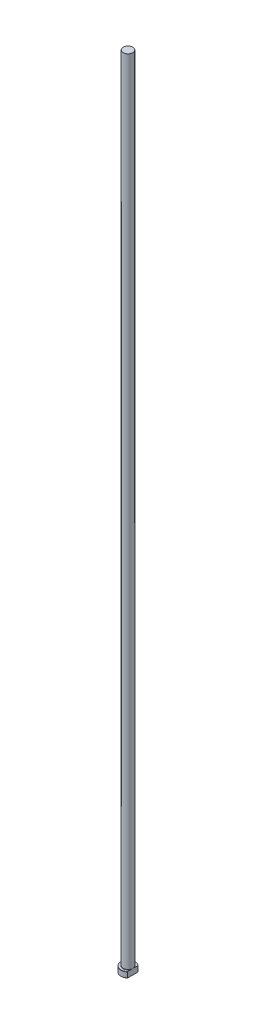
ISO-10303-21;
HEADER;
FILE_DESCRIPTION(('STEP AP214'),'2;1');
FILE_NAME('part.step','',(''),(''),'','','');
FILE_SCHEMA(('AUTOMOTIVE_DESIGN { 1 0 10303 214 1 1 1 1 }'));
ENDSEC;
DATA;
#1=APPLICATION_CONTEXT('core data for automotive mechanical design processes');
#2=APPLICATION_PROTOCOL_DEFINITION('international standard','automotive_design',2000,#1);
#3=PRODUCT_CONTEXT('',#1,'mechanical');
#4=PRODUCT('Part','Part','',(#3));
#5=PRODUCT_RELATED_PRODUCT_CATEGORY('part','',(#4));
#6=PRODUCT_DEFINITION_FORMATION('','',#4);
#7=PRODUCT_DEFINITION_CONTEXT('part definition',#1,'design');
#8=PRODUCT_DEFINITION('design','',#6,#7);
#9=PRODUCT_DEFINITION_SHAPE('','',#8);
#10=(LENGTH_UNIT() NAMED_UNIT(*) SI_UNIT(.MILLI.,.METRE.));
#11=(NAMED_UNIT(*) PLANE_ANGLE_UNIT() SI_UNIT($,.RADIAN.));
#12=(NAMED_UNIT(*) SI_UNIT($,.STERADIAN.) SOLID_ANGLE_UNIT());
#13=UNCERTAINTY_MEASURE_WITH_UNIT(LENGTH_MEASURE(1.E-05),#10,'distance_accuracy_value','');
#14=(GEOMETRIC_REPRESENTATION_CONTEXT(3) GLOBAL_UNCERTAINTY_ASSIGNED_CONTEXT((#13)) GLOBAL_UNIT_ASSIGNED_CONTEXT((#10,
#11,#12)) REPRESENTATION_CONTEXT('',''));
#15=CARTESIAN_POINT('',(0.,0.,0.));
#16=DIRECTION('',(0.,0.,1.));
#17=DIRECTION('',(1.,0.,0.));
#18=AXIS2_PLACEMENT_3D('',#15,#16,#17);
#19=CARTESIAN_POINT('',(0.,0.,0.));
#20=DIRECTION('',(0.,-1.,0.));
#21=DIRECTION('',(0.,0.,-1.));
#22=AXIS2_PLACEMENT_3D('',#19,#20,#21);
#23=PLANE('',#22);
#24=CARTESIAN_POINT('',(0.,0.,0.));
#25=DIRECTION('',(0.,-1.,0.));
#26=DIRECTION('',(0.,0.,-1.));
#27=AXIS2_PLACEMENT_3D('',#24,#25,#26);
#28=CIRCLE('',#27,8.79999999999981);
#29=CARTESIAN_POINT('',(5.99999999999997,0.,6.4373907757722));
#30=VERTEX_POINT('',#29);
#31=CARTESIAN_POINT('',(5.99999999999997,0.,-6.4373907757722));
#32=VERTEX_POINT('',#31);
#33=EDGE_CURVE('E98',#30,#32,#28,.T.);
#34=ORIENTED_EDGE('',*,*,#33,.T.);
#35=DIRECTION('',(0.,0.,1.));
#36=VECTOR('',#35,1.);
#37=CARTESIAN_POINT('',(5.99999999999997,0.,-6.70820393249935));
#38=LINE('',#37,#36);
#39=EDGE_CURVE('E83',#32,#30,#38,.T.);
#40=ORIENTED_EDGE('',*,*,#39,.T.);
#41=EDGE_LOOP('',(#34,#40));
#42=FACE_BOUND('',#41,.T.);
#43=ADVANCED_FACE('F32',(#42),#23,.T.);
#44=CARTESIAN_POINT('',(0.,259.958771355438,0.));
#45=DIRECTION('',(0.,1.,0.));
#46=DIRECTION('',(0.,0.,1.));
#47=AXIS2_PLACEMENT_3D('',#44,#45,#46);
#48=CYLINDRICAL_SURFACE('',#47,8.99999999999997);
#49=CARTESIAN_POINT('',(0.,6.79999999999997,0.));
#50=DIRECTION('',(0.,1.,0.));
#51=DIRECTION('',(0.,0.,1.));
#52=AXIS2_PLACEMENT_3D('',#49,#50,#51);
#53=CIRCLE('',#52,8.99999999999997);
#54=CARTESIAN_POINT('',(5.99999999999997,6.79999999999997,6.70820393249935));
#55=VERTEX_POINT('',#54);
#56=CARTESIAN_POINT('',(5.99999999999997,6.79999999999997,-6.70820393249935));
#57=VERTEX_POINT('',#56);
#58=EDGE_CURVE('E104',#55,#57,#53,.F.);
#59=ORIENTED_EDGE('',*,*,#58,.T.);
#60=DIRECTION('',(0.,-1.,0.));
#61=VECTOR('',#60,1.);
#62=CARTESIAN_POINT('',(5.99999999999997,1000.,-6.70820393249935));
#63=LINE('',#62,#61);
#64=CARTESIAN_POINT('',(5.99999999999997,0.200000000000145,-6.70820393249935));
#65=VERTEX_POINT('',#64);
#66=EDGE_CURVE('E183',#57,#65,#63,.T.);
#67=ORIENTED_EDGE('',*,*,#66,.T.);
#68=CARTESIAN_POINT('',(0.,0.200000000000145,0.));
#69=DIRECTION('',(0.,-1.,0.));
#70=DIRECTION('',(0.,0.,-1.));
#71=AXIS2_PLACEMENT_3D('',#68,#69,#70);
#72=CIRCLE('',#71,8.99999999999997);
#73=CARTESIAN_POINT('',(5.99999999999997,0.200000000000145,6.70820393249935));
#74=VERTEX_POINT('',#73);
#75=EDGE_CURVE('E100',#65,#74,#72,.F.);
#76=ORIENTED_EDGE('',*,*,#75,.T.);
#77=DIRECTION('',(0.,-1.,0.));
#78=VECTOR('',#77,1.);
#79=CARTESIAN_POINT('',(5.99999999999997,1000.,6.70820393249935));
#80=LINE('',#79,#78);
#81=EDGE_CURVE('E93',#55,#74,#80,.T.);
#82=ORIENTED_EDGE('',*,*,#81,.F.);
#83=EDGE_LOOP('',(#59,#67,#76,#82));
#84=FACE_BOUND('',#83,.T.);
#85=ADVANCED_FACE('F158',(#84),#48,.T.);
#86=CARTESIAN_POINT('',(-8.99999999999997,7.,0.));
#87=DIRECTION('',(0.,1.,0.));
#88=DIRECTION('',(0.,0.,1.));
#89=AXIS2_PLACEMENT_3D('',#86,#87,#88);
#90=PLANE('',#89);
#91=CARTESIAN_POINT('',(0.,7.,0.));
#92=DIRECTION('',(0.,1.,0.));
#93=DIRECTION('',(0.,0.,1.));
#94=AXIS2_PLACEMENT_3D('',#91,#92,#93);
#95=CIRCLE('',#94,8.79999999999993);
#96=CARTESIAN_POINT('',(5.99999999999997,7.,-6.43739077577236));
#97=VERTEX_POINT('',#96);
#98=CARTESIAN_POINT('',(5.99999999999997,7.,6.43739077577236));
#99=VERTEX_POINT('',#98);
#100=EDGE_CURVE('E178',#97,#99,#95,.T.);
#101=ORIENTED_EDGE('',*,*,#100,.T.);
#102=DIRECTION('',(0.,0.,-1.));
#103=VECTOR('',#102,1.);
#104=CARTESIAN_POINT('',(5.99999999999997,7.,0.));
#105=LINE('',#104,#103);
#106=CARTESIAN_POINT('',(5.99999999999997,6.99999999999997,1.92093727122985));
#107=VERTEX_POINT('',#106);
#108=EDGE_CURVE('E57',#99,#107,#105,.T.);
#109=ORIENTED_EDGE('',*,*,#108,.T.);
#110=CARTESIAN_POINT('',(0.,7.,0.));
#111=DIRECTION('',(0.,1.,0.));
#112=DIRECTION('',(0.,0.,1.));
#113=AXIS2_PLACEMENT_3D('',#110,#111,#112);
#114=CIRCLE('',#113,6.29999999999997);
#115=CARTESIAN_POINT('',(5.99999999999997,6.99999999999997,-1.92093727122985));
#116=VERTEX_POINT('',#115);
#117=EDGE_CURVE('E107',#107,#116,#114,.F.);
#118=ORIENTED_EDGE('',*,*,#117,.T.);
#119=EDGE_CURVE('E136',#116,#97,#105,.T.);
#120=ORIENTED_EDGE('',*,*,#119,.T.);
#121=EDGE_LOOP('',(#101,#109,#118,#120));
#122=FACE_BOUND('',#121,.T.);
#123=ADVANCED_FACE('F147',(#122),#90,.T.);
#124=CARTESIAN_POINT('',(0.,7.00000000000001,0.));
#125=DIRECTION('',(0.,-1.,0.));
#126=DIRECTION('',(0.,0.,-1.));
#127=AXIS2_PLACEMENT_3D('',#124,#125,#126);
#128=CONICAL_SURFACE('',#127,8.79999999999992,0.785398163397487);
#129=ORIENTED_EDGE('',*,*,#58,.F.);
#130=CARTESIAN_POINT('',(5.99999999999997,-0.132115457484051,14.7591430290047));
#131=CARTESIAN_POINT('',(5.99999999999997,0.0733919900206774,14.537299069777));
#132=CARTESIAN_POINT('',(5.99999999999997,0.278550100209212,14.3151315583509));
#133=CARTESIAN_POINT('',(5.99999999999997,0.688060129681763,13.8700519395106));
#134=CARTESIAN_POINT('',(5.99999999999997,0.892412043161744,13.647139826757));
#135=CARTESIAN_POINT('',(5.99999999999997,1.50418032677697,12.9770492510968));
#136=CARTESIAN_POINT('',(5.99999999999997,1.91022091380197,12.5286117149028));
#137=CARTESIAN_POINT('',(5.99999999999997,2.71980134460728,11.6246427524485));
#138=CARTESIAN_POINT('',(5.99999999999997,3.12331180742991,11.1690849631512));
#139=CARTESIAN_POINT('',(5.99999999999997,3.92341525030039,10.2520077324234));
#140=CARTESIAN_POINT('',(5.99999999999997,4.32000903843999,9.79048899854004));
#141=CARTESIAN_POINT('',(5.99999999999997,5.02478816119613,8.95241885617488));
#142=CARTESIAN_POINT('',(5.99999999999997,5.33476112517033,8.57737771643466));
#143=CARTESIAN_POINT('',(5.99999999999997,5.79310598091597,8.00939108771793));
#144=CARTESIAN_POINT('',(5.99999999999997,5.94480562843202,7.81913145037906));
#145=CARTESIAN_POINT('',(5.99999999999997,6.24553651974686,7.4365172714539));
#146=CARTESIAN_POINT('',(5.99999999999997,6.39456781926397,7.24416277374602));
#147=CARTESIAN_POINT('',(5.99999999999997,6.68925367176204,6.85721540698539));
#148=CARTESIAN_POINT('',(5.99999999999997,6.83491177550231,6.66262524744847));
#149=CARTESIAN_POINT('',(5.99999999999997,7.12230719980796,6.27057707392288));
#150=CARTESIAN_POINT('',(5.99999999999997,7.26404470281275,6.07311919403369));
#151=CARTESIAN_POINT('',(5.99999999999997,7.54263362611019,5.67488713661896));
#152=CARTESIAN_POINT('',(5.99999999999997,7.67948689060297,5.4741142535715));
#153=CARTESIAN_POINT('',(5.99999999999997,7.94714213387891,5.06858845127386));
#154=CARTESIAN_POINT('',(5.99999999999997,8.07794479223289,4.86383598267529));
#155=CARTESIAN_POINT('',(5.99999999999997,8.32827993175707,4.45554322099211));
#156=CARTESIAN_POINT('',(5.99999999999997,8.44802771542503,4.25213564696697));
#157=CARTESIAN_POINT('',(5.99999999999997,8.6783797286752,3.8401373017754));
#158=CARTESIAN_POINT('',(5.99999999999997,8.78898293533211,3.63154595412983));
#159=CARTESIAN_POINT('',(5.99999999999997,8.99840984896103,3.20863811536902));
#160=CARTESIAN_POINT('',(5.99999999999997,9.09724073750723,2.99432521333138));
#161=CARTESIAN_POINT('',(5.99999999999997,9.27991776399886,2.55937061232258));
#162=CARTESIAN_POINT('',(5.99999999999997,9.36376811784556,2.33873071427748));
#163=CARTESIAN_POINT('',(5.99999999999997,9.49627737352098,1.94012294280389));
#164=CARTESIAN_POINT('',(5.99999999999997,9.5486217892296,1.76338731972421));
#165=CARTESIAN_POINT('',(5.99999999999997,9.639780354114,1.40643307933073));
#166=CARTESIAN_POINT('',(5.99999999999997,9.67859618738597,1.22621489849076));
#167=CARTESIAN_POINT('',(5.99999999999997,9.7407731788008,0.863704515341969));
#168=CARTESIAN_POINT('',(5.99999999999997,9.76418479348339,0.681421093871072));
#169=CARTESIAN_POINT('',(5.99999999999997,9.79447814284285,0.315473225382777));
#170=CARTESIAN_POINT('',(5.99999999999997,9.80136083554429,0.131808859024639));
#171=CARTESIAN_POINT('',(5.99999999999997,9.79818788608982,-0.235881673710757));
#172=CARTESIAN_POINT('',(5.99999999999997,9.78808514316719,-0.419907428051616));
#173=CARTESIAN_POINT('',(5.99999999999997,9.75144464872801,-0.786302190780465));
#174=CARTESIAN_POINT('',(5.99999999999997,9.7249055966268,-0.968671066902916));
#175=CARTESIAN_POINT('',(5.99999999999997,9.65670736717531,-1.33110767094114));
#176=CARTESIAN_POINT('',(5.99999999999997,9.6150012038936,-1.5111664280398));
#177=CARTESIAN_POINT('',(5.99999999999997,9.51838325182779,-1.86766519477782));
#178=CARTESIAN_POINT('',(5.99999999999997,9.46347085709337,-2.04410503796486));
#179=CARTESIAN_POINT('',(5.99999999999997,9.33563659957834,-2.41270922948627));
#180=CARTESIAN_POINT('',(5.99999999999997,9.26138327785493,-2.60440790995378));
#181=CARTESIAN_POINT('',(5.99999999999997,9.10155310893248,-2.9830649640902));
#182=CARTESIAN_POINT('',(5.99999999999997,9.01597146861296,-3.17002129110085));
#183=CARTESIAN_POINT('',(5.99999999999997,8.8355347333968,-3.53975380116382));
#184=CARTESIAN_POINT('',(5.99999999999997,8.74066449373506,-3.72252253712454));
#185=CARTESIAN_POINT('',(5.99999999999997,8.54355472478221,-4.08398624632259));
#186=CARTESIAN_POINT('',(5.99999999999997,8.4413161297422,-4.26268173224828));
#187=CARTESIAN_POINT('',(5.99999999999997,8.22953960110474,-4.61872309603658));
#188=CARTESIAN_POINT('',(5.99999999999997,8.11992610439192,-4.79602381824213));
#189=CARTESIAN_POINT('',(5.99999999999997,7.89571048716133,-5.14743548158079));
#190=CARTESIAN_POINT('',(5.99999999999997,7.78110825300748,-5.32154634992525));
#191=CARTESIAN_POINT('',(5.99999999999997,7.54792782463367,-5.66682327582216));
#192=CARTESIAN_POINT('',(5.99999999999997,7.42935372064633,-5.83799210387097));
#193=CARTESIAN_POINT('',(5.99999999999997,7.18881616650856,-6.17793707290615));
#194=CARTESIAN_POINT('',(5.99999999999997,7.0668525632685,-6.34671310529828));
#195=CARTESIAN_POINT('',(5.99999999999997,6.80539778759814,-6.70216781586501));
#196=CARTESIAN_POINT('',(5.99999999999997,6.66554966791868,-6.88858356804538));
#197=CARTESIAN_POINT('',(5.99999999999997,6.38292065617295,-7.25918139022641));
#198=CARTESIAN_POINT('',(5.99999999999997,6.24013967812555,-7.44336339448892));
#199=CARTESIAN_POINT('',(5.99999999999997,5.80812002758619,-7.99307414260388));
#200=CARTESIAN_POINT('',(5.99999999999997,5.51523002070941,-8.35573349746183));
#201=CARTESIAN_POINT('',(5.99999999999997,4.92224619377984,-9.07562940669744));
#202=CARTESIAN_POINT('',(5.99999999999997,4.6221460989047,-9.432860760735));
#203=CARTESIAN_POINT('',(5.99999999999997,4.01677382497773,-10.1429201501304));
#204=CARTESIAN_POINT('',(5.99999999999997,3.71150152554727,-10.4957480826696));
#205=CARTESIAN_POINT('',(5.99999999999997,3.11456796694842,-11.1779164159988));
#206=CARTESIAN_POINT('',(5.99999999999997,2.82312451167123,-11.5074478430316));
#207=CARTESIAN_POINT('',(5.99999999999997,2.2374718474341,-12.164052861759));
#208=CARTESIAN_POINT('',(5.99999999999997,1.94326258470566,-12.491126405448));
#209=CARTESIAN_POINT('',(5.99999999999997,1.35320776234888,-13.1426363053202));
#210=CARTESIAN_POINT('',(5.99999999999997,1.0573664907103,-13.4670765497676));
#211=CARTESIAN_POINT('',(5.99999999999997,0.463882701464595,-14.1142803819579));
#212=CARTESIAN_POINT('',(5.99999999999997,0.166240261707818,-14.4370440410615));
#213=CARTESIAN_POINT('',(5.99999999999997,-0.132115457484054,-14.7591430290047));
#214=B_SPLINE_CURVE_WITH_KNOTS('',3,(#130,#131,#132,#133,#134,#135,#136,#137,#138,#139,#140,
#141,#142,#143,#144,#145,#146,#147,#148,#149,#150,#151,#152,#153,#154,#155,#156,#157,#158,#159,
#160,#161,#162,#163,#164,#165,#166,#167,#168,#169,#170,#171,#172,#173,#174,#175,#176,#177,#178,
#179,#180,#181,#182,#183,#184,#185,#186,#187,#188,#189,#190,#191,#192,#193,#194,#195,#196,#197,
#198,#199,#200,#201,#202,#203,#204,#205,#206,#207,#208,#209,#210,#211,#212,#213),.UNSPECIFIED.,
.F.,.F.,(4,2,2,2,2,2,2,2,2,2,2,2,2,2,2,2,2,2,2,2,2,2,2,2,2,2,2,2,2,2,2,2,2,2,2,2,2,2,2,2,2,4),
(0.,0.907210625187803,1.81442776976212,3.62925156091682,5.45490487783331,7.28034345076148,
8.73990838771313,9.46989218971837,10.1998607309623,10.9290223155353,11.6581499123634,
12.3869992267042,13.1157664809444,13.8236973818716,14.531707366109,15.2392832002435,
15.946659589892,16.4991819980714,17.0516356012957,17.6022705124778,18.152873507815,
18.7050058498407,19.2571818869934,19.811083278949,20.3650100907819,20.9812908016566,
21.5978331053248,22.2153979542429,22.8328846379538,23.4581285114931,24.0833866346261,
24.7080195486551,25.3326807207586,26.0317691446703,26.7308780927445,28.1292235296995,
29.5288334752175,30.9284760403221,32.2482200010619,33.5679896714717,34.8851960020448,
36.2023458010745),.UNSPECIFIED.);
#215=EDGE_CURVE('E135',#55,#99,#214,.T.);
#216=ORIENTED_EDGE('',*,*,#215,.T.);
#217=ORIENTED_EDGE('',*,*,#100,.F.);
#218=EDGE_CURVE('E127',#97,#57,#214,.T.);
#219=ORIENTED_EDGE('',*,*,#218,.T.);
#220=EDGE_LOOP('',(#129,#216,#217,#219));
#221=FACE_BOUND('',#220,.T.);
#222=ADVANCED_FACE('F143',(#221),#128,.T.);
#223=CARTESIAN_POINT('',(0.,0.200000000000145,0.));
#224=DIRECTION('',(0.,1.,0.));
#225=DIRECTION('',(0.,0.,1.));
#226=AXIS2_PLACEMENT_3D('',#223,#224,#225);
#227=CONICAL_SURFACE('',#226,8.99999999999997,0.785398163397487);
#228=ORIENTED_EDGE('',*,*,#75,.F.);
#229=CARTESIAN_POINT('',(5.99999999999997,7.13211545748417,-14.7591430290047));
#230=CARTESIAN_POINT('',(5.99999999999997,6.92660800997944,-14.537299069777));
#231=CARTESIAN_POINT('',(5.99999999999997,6.7214498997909,-14.3151315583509));
#232=CARTESIAN_POINT('',(5.99999999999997,6.31193987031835,-13.8700519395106));
#233=CARTESIAN_POINT('',(5.99999999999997,6.10758795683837,-13.647139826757));
#234=CARTESIAN_POINT('',(5.99999999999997,5.49581967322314,-12.9770492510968));
#235=CARTESIAN_POINT('',(5.99999999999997,5.08977908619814,-12.5286117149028));
#236=CARTESIAN_POINT('',(5.99999999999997,4.28019865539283,-11.6246427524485));
#237=CARTESIAN_POINT('',(5.99999999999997,3.8766881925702,-11.1690849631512));
#238=CARTESIAN_POINT('',(5.99999999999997,3.07658474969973,-10.2520077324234));
#239=CARTESIAN_POINT('',(5.99999999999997,2.67999096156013,-9.79048899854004));
#240=CARTESIAN_POINT('',(5.99999999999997,1.97521183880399,-8.95241885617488));
#241=CARTESIAN_POINT('',(5.99999999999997,1.66523887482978,-8.57737771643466));
#242=CARTESIAN_POINT('',(5.99999999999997,1.20689401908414,-8.00939108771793));
#243=CARTESIAN_POINT('',(5.99999999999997,1.05519437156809,-7.81913145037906));
#244=CARTESIAN_POINT('',(5.99999999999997,0.754463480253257,-7.4365172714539));
#245=CARTESIAN_POINT('',(5.99999999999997,0.605432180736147,-7.24416277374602));
#246=CARTESIAN_POINT('',(5.99999999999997,0.310746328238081,-6.85721540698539));
#247=CARTESIAN_POINT('',(5.99999999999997,0.165088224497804,-6.66262524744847));
#248=CARTESIAN_POINT('',(5.99999999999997,-0.122307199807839,-6.27057707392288));
#249=CARTESIAN_POINT('',(5.99999999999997,-0.264044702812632,-6.07311919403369));
#250=CARTESIAN_POINT('',(5.99999999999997,-0.542633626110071,-5.67488713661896));
#251=CARTESIAN_POINT('',(5.99999999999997,-0.679486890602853,-5.4741142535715));
#252=CARTESIAN_POINT('',(5.99999999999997,-0.947142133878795,-5.06858845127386));
#253=CARTESIAN_POINT('',(5.99999999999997,-1.07794479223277,-4.86383598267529));
#254=CARTESIAN_POINT('',(5.99999999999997,-1.32827993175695,-4.45554322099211));
#255=CARTESIAN_POINT('',(5.99999999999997,-1.44802771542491,-4.25213564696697));
#256=CARTESIAN_POINT('',(5.99999999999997,-1.67837972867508,-3.84013730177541));
#257=CARTESIAN_POINT('',(5.99999999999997,-1.78898293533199,-3.63154595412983));
#258=CARTESIAN_POINT('',(5.99999999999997,-1.99840984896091,-3.20863811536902));
#259=CARTESIAN_POINT('',(5.99999999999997,-2.09724073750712,-2.99432521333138));
#260=CARTESIAN_POINT('',(5.99999999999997,-2.27991776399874,-2.55937061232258));
#261=CARTESIAN_POINT('',(5.99999999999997,-2.36376811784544,-2.33873071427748));
#262=CARTESIAN_POINT('',(5.99999999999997,-2.49627737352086,-1.94012294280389));
#263=CARTESIAN_POINT('',(5.99999999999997,-2.54862178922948,-1.76338731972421));
#264=CARTESIAN_POINT('',(5.99999999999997,-2.63978035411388,-1.40643307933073));
#265=CARTESIAN_POINT('',(5.99999999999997,-2.67859618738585,-1.22621489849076));
#266=CARTESIAN_POINT('',(5.99999999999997,-2.74077317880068,-0.863704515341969));
#267=CARTESIAN_POINT('',(5.99999999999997,-2.76418479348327,-0.68142109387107));
#268=CARTESIAN_POINT('',(5.99999999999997,-2.79447814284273,-0.315473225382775));
#269=CARTESIAN_POINT('',(5.99999999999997,-2.80136083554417,-0.131808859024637));
#270=CARTESIAN_POINT('',(5.99999999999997,-2.79818788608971,0.235881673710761));
#271=CARTESIAN_POINT('',(5.99999999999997,-2.78808514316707,0.419907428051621));
#272=CARTESIAN_POINT('',(5.99999999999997,-2.75144464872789,0.786302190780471));
#273=CARTESIAN_POINT('',(5.99999999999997,-2.72490559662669,0.968671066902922));
#274=CARTESIAN_POINT('',(5.99999999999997,-2.65670736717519,1.33110767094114));
#275=CARTESIAN_POINT('',(5.99999999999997,-2.61500120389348,1.5111664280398));
#276=CARTESIAN_POINT('',(5.99999999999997,-2.51838325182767,1.86766519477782));
#277=CARTESIAN_POINT('',(5.99999999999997,-2.46347085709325,2.04410503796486));
#278=CARTESIAN_POINT('',(5.99999999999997,-2.33563659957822,2.41270922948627));
#279=CARTESIAN_POINT('',(5.99999999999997,-2.26138327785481,2.60440790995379));
#280=CARTESIAN_POINT('',(5.99999999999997,-2.10155310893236,2.98306496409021));
#281=CARTESIAN_POINT('',(5.99999999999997,-2.01597146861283,3.17002129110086));
#282=CARTESIAN_POINT('',(5.99999999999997,-1.83553473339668,3.53975380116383));
#283=CARTESIAN_POINT('',(5.99999999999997,-1.74066449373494,3.72252253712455));
#284=CARTESIAN_POINT('',(5.99999999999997,-1.54355472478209,4.0839862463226));
#285=CARTESIAN_POINT('',(5.99999999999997,-1.44131612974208,4.26268173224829));
#286=CARTESIAN_POINT('',(5.99999999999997,-1.22953960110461,4.61872309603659));
#287=CARTESIAN_POINT('',(5.99999999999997,-1.11992610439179,4.79602381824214));
#288=CARTESIAN_POINT('',(5.99999999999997,-0.895710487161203,5.1474354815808));
#289=CARTESIAN_POINT('',(5.99999999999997,-0.781108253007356,5.32154634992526));
#290=CARTESIAN_POINT('',(5.99999999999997,-0.547927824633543,5.66682327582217));
#291=CARTESIAN_POINT('',(5.99999999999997,-0.429353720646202,5.83799210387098));
#292=CARTESIAN_POINT('',(5.99999999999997,-0.188816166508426,6.17793707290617));
#293=CARTESIAN_POINT('',(5.99999999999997,-0.0668525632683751,6.34671310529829));
#294=CARTESIAN_POINT('',(5.99999999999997,0.194602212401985,6.70216781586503));
#295=CARTESIAN_POINT('',(5.99999999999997,0.334450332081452,6.8885835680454));
#296=CARTESIAN_POINT('',(5.99999999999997,0.617079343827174,7.25918139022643));
#297=CARTESIAN_POINT('',(5.99999999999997,0.759860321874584,7.44336339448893));
#298=CARTESIAN_POINT('',(5.99999999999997,1.19187997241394,7.99307414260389));
#299=CARTESIAN_POINT('',(5.99999999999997,1.48476997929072,8.35573349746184));
#300=CARTESIAN_POINT('',(5.99999999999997,2.07775380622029,9.07562940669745));
#301=CARTESIAN_POINT('',(5.99999999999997,2.37785390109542,9.43286076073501));
#302=CARTESIAN_POINT('',(5.99999999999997,2.9832261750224,10.1429201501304));
#303=CARTESIAN_POINT('',(5.99999999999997,3.28849847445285,10.4957480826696));
#304=CARTESIAN_POINT('',(5.99999999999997,3.8854320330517,11.1779164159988));
#305=CARTESIAN_POINT('',(5.99999999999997,4.1768754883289,11.5074478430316));
#306=CARTESIAN_POINT('',(5.99999999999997,4.76252815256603,12.1640528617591));
#307=CARTESIAN_POINT('',(5.99999999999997,5.05673741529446,12.491126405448));
#308=CARTESIAN_POINT('',(5.99999999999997,5.64679223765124,13.1426363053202));
#309=CARTESIAN_POINT('',(5.99999999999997,5.94263350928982,13.4670765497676));
#310=CARTESIAN_POINT('',(5.99999999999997,6.53611729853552,14.1142803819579));
#311=CARTESIAN_POINT('',(5.99999999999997,6.8337597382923,14.4370440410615));
#312=CARTESIAN_POINT('',(5.99999999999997,7.13211545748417,14.7591430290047));
#313=B_SPLINE_CURVE_WITH_KNOTS('',3,(#229,#230,#231,#232,#233,#234,#235,#236,#237,#238,#239,
#240,#241,#242,#243,#244,#245,#246,#247,#248,#249,#250,#251,#252,#253,#254,#255,#256,#257,#258,
#259,#260,#261,#262,#263,#264,#265,#266,#267,#268,#269,#270,#271,#272,#273,#274,#275,#276,#277,
#278,#279,#280,#281,#282,#283,#284,#285,#286,#287,#288,#289,#290,#291,#292,#293,#294,#295,#296,
#297,#298,#299,#300,#301,#302,#303,#304,#305,#306,#307,#308,#309,#310,#311,#312),.UNSPECIFIED.,
.F.,.F.,(4,2,2,2,2,2,2,2,2,2,2,2,2,2,2,2,2,2,2,2,2,2,2,2,2,2,2,2,2,2,2,2,2,2,2,2,2,2,2,2,2,4),
(0.,0.907210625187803,1.81442776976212,3.62925156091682,5.45490487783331,7.28034345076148,
8.73990838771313,9.46989218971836,10.1998607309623,10.9290223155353,11.6581499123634,
12.3869992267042,13.1157664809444,13.8236973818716,14.531707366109,15.2392832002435,
15.946659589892,16.4991819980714,17.0516356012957,17.6022705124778,18.152873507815,
18.7050058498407,19.2571818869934,19.811083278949,20.3650100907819,20.9812908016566,
21.5978331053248,22.2153979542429,22.8328846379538,23.4581285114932,24.0833866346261,
24.7080195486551,25.3326807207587,26.0317691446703,26.7308780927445,28.1292235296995,
29.5288334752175,30.9284760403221,32.2482200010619,33.5679896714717,34.8851960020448,
36.2023458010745),.UNSPECIFIED.);
#314=EDGE_CURVE('E86',#65,#32,#313,.T.);
#315=ORIENTED_EDGE('',*,*,#314,.T.);
#316=ORIENTED_EDGE('',*,*,#33,.F.);
#317=EDGE_CURVE('E89',#30,#74,#313,.T.);
#318=ORIENTED_EDGE('',*,*,#317,.T.);
#319=EDGE_LOOP('',(#228,#315,#316,#318));
#320=FACE_BOUND('',#319,.T.);
#321=ADVANCED_FACE('F97',(#320),#227,.T.);
#322=CARTESIAN_POINT('',(0.,7.29999999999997,0.));
#323=DIRECTION('',(0.,1.,0.));
#324=DIRECTION('',(0.,0.,1.));
#325=AXIS2_PLACEMENT_3D('',#322,#323,#324);
#326=TOROIDAL_SURFACE('',#325,6.29999999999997,0.3);
#327=CARTESIAN_POINT('',(5.99999999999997,7.29999999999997,0.));
#328=CARTESIAN_POINT('',(5.99999999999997,7.30000062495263,1.34604287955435E-10));
#329=CARTESIAN_POINT('',(5.99999999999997,7.30000124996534,-2.85495107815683E-07));
#330=CARTESIAN_POINT('',(5.99999999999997,7.30000241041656,-1.04928090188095E-06));
#331=CARTESIAN_POINT('',(5.99999999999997,7.30000292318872,-1.54785170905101E-06));
#332=CARTESIAN_POINT('',(5.99999999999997,7.30000401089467,-2.74944383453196E-06));
#333=CARTESIAN_POINT('',(5.99999999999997,7.30000456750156,-3.47196539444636E-06));
#334=CARTESIAN_POINT('',(5.99999999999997,7.30000554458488,-4.95172582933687E-06));
#335=CARTESIAN_POINT('',(5.99999999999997,7.30000596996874,-5.70604365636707E-06));
#336=CARTESIAN_POINT('',(5.99999999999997,7.30000759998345,-8.69525109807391E-06));
#337=CARTESIAN_POINT('',(5.99999999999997,7.30000872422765,-1.0978182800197E-05));
#338=CARTESIAN_POINT('',(5.99999999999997,7.30001052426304,-1.54456346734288E-05));
#339=CARTESIAN_POINT('',(5.99999999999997,7.3000112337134,-1.76170762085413E-05));
#340=CARTESIAN_POINT('',(5.99999999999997,7.30001429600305,-2.69928123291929E-05));
#341=CARTESIAN_POINT('',(5.99999999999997,7.30001664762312,-3.42000265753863E-05));
#342=CARTESIAN_POINT('',(5.99999999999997,7.30002002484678,-4.76829001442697E-05));
#343=CARTESIAN_POINT('',(5.99999999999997,7.30002120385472,-5.39195609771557E-05));
#344=CARTESIAN_POINT('',(5.99999999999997,7.30002992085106,-0.000100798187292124));
#345=CARTESIAN_POINT('',(5.99999999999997,7.30003667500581,-0.00014152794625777));
#346=CARTESIAN_POINT('',(5.99999999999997,7.30006623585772,-0.000303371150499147));
#347=CARTESIAN_POINT('',(5.99999999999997,7.30009428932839,-0.000423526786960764));
#348=CARTESIAN_POINT('',(5.99999999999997,7.30020425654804,-0.000901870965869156));
#349=CARTESIAN_POINT('',(5.99999999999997,7.3002828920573,-0.00126055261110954));
#350=CARTESIAN_POINT('',(5.99999999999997,7.30059934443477,-0.0026940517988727));
#351=CARTESIAN_POINT('',(5.99999999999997,7.3008413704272,-0.0037682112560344));
#352=CARTESIAN_POINT('',(5.99999999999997,7.30185255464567,-0.0082672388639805));
#353=CARTESIAN_POINT('',(5.99999999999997,7.30261638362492,-0.0116929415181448));
#354=CARTESIAN_POINT('',(5.99999999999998,7.30945824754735,-0.0423635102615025));
#355=CARTESIAN_POINT('',(5.99999999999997,7.31555811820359,-0.0696050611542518));
#356=CARTESIAN_POINT('',(5.99999999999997,7.32747716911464,-0.122985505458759));
#357=CARTESIAN_POINT('',(5.99999999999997,7.33329766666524,-0.149124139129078));
#358=CARTESIAN_POINT('',(5.99999999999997,7.34565922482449,-0.204790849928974));
#359=CARTESIAN_POINT('',(5.99999999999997,7.352196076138,-0.234319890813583));
#360=CARTESIAN_POINT('',(5.99999999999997,7.36527652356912,-0.29372170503));
#361=CARTESIAN_POINT('',(5.99999999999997,7.37181938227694,-0.323594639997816));
#362=CARTESIAN_POINT('',(5.99999999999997,7.38741819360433,-0.395325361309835));
#363=CARTESIAN_POINT('',(5.99999999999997,7.39643140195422,-0.437192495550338));
#364=CARTESIAN_POINT('',(5.99999999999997,7.41397520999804,-0.519837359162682));
#365=CARTESIAN_POINT('',(5.99999999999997,7.4225122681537,-0.560613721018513));
#366=CARTESIAN_POINT('',(5.99999999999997,7.45005469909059,-0.694529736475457));
#367=CARTESIAN_POINT('',(5.99999999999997,7.46845270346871,-0.787796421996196));
#368=CARTESIAN_POINT('',(5.99999999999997,7.50309772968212,-0.975673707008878));
#369=CARTESIAN_POINT('',(5.99999999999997,7.51932210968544,-1.07028855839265));
#370=CARTESIAN_POINT('',(5.99999999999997,7.54979671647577,-1.26922112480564));
#371=CARTESIAN_POINT('',(5.99999999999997,7.56370439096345,-1.37359247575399));
#372=CARTESIAN_POINT('',(5.99999999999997,7.58567213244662,-1.58267692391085));
#373=CARTESIAN_POINT('',(5.99999999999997,7.59375049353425,-1.68738790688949));
#374=CARTESIAN_POINT('',(5.99999999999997,7.59943466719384,-1.8430899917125));
#375=CARTESIAN_POINT('',(5.99999999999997,7.60029184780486,-1.89396002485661));
#376=CARTESIAN_POINT('',(5.99999999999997,7.5995288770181,-1.99574511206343));
#377=CARTESIAN_POINT('',(5.99999999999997,7.59790613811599,-2.04666015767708));
#378=CARTESIAN_POINT('',(5.99999999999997,7.59158346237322,-2.14740525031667));
#379=CARTESIAN_POINT('',(5.99999999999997,7.58693864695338,-2.19723851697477));
#380=CARTESIAN_POINT('',(5.99999999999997,7.57369485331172,-2.29634018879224));
#381=CARTESIAN_POINT('',(5.99999999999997,7.56510170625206,-2.3456093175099));
#382=CARTESIAN_POINT('',(5.99999999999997,7.54513600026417,-2.43101613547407));
#383=CARTESIAN_POINT('',(5.99999999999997,7.53495732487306,-2.46741817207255));
#384=CARTESIAN_POINT('',(5.99999999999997,7.5163599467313,-2.52083307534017));
#385=CARTESIAN_POINT('',(5.99999999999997,7.50961541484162,-2.53842082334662));
#386=CARTESIAN_POINT('',(5.99999999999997,7.49476050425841,-2.57300282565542));
#387=CARTESIAN_POINT('',(5.99999999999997,7.48665036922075,-2.58999718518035));
#388=CARTESIAN_POINT('',(5.99999999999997,7.4656679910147,-2.62872971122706));
#389=CARTESIAN_POINT('',(5.99999999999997,7.45211281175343,-2.65012863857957));
#390=CARTESIAN_POINT('',(5.99999999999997,7.42848584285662,-2.67978235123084));
#391=CARTESIAN_POINT('',(5.99999999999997,7.42001211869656,-2.68929941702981));
#392=CARTESIAN_POINT('',(5.99999999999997,7.40175979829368,-2.70700164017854));
#393=CARTESIAN_POINT('',(5.99999999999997,7.39198420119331,-2.71518976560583));
#394=CARTESIAN_POINT('',(5.99999999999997,7.37475773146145,-2.7269570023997));
#395=CARTESIAN_POINT('',(5.99999999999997,7.36772137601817,-2.73113834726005));
#396=CARTESIAN_POINT('',(5.99999999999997,7.35309194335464,-2.73838811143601));
#397=CARTESIAN_POINT('',(5.99999999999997,7.34549938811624,-2.7414575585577));
#398=CARTESIAN_POINT('',(5.99999999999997,7.32979919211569,-2.74623687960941));
#399=CARTESIAN_POINT('',(5.99999999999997,7.32168697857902,-2.74793213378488));
#400=CARTESIAN_POINT('',(5.99999999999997,7.30528814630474,-2.74970225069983));
#401=CARTESIAN_POINT('',(5.99999999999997,7.29700168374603,-2.74977850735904));
#402=CARTESIAN_POINT('',(5.99999999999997,7.2816016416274,-2.74839814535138));
#403=CARTESIAN_POINT('',(5.99999999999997,7.27447007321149,-2.74713049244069));
#404=CARTESIAN_POINT('',(5.99999999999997,7.26050316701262,-2.74347158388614));
#405=CARTESIAN_POINT('',(5.99999999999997,7.25366802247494,-2.7410796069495));
#406=CARTESIAN_POINT('',(5.99999999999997,7.23783277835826,-2.73423902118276));
#407=CARTESIAN_POINT('',(5.99999999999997,7.22902314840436,-2.72935244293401));
#408=CARTESIAN_POINT('',(5.99999999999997,7.21228574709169,-2.7182516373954));
#409=CARTESIAN_POINT('',(5.99999999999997,7.20436026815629,-2.71203407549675));
#410=CARTESIAN_POINT('',(5.99999999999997,7.18433696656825,-2.69420240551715));
#411=CARTESIAN_POINT('',(5.99999999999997,7.17298706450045,-2.68175715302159));
#412=CARTESIAN_POINT('',(5.99999999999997,7.15219498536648,-2.65539556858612));
#413=CARTESIAN_POINT('',(5.99999999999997,7.14275658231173,-2.64147640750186));
#414=CARTESIAN_POINT('',(5.99999999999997,7.12508934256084,-2.61223187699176));
#415=CARTESIAN_POINT('',(5.99999999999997,7.11691464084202,-2.59687428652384));
#416=CARTESIAN_POINT('',(5.99999999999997,7.10186133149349,-2.56552911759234));
#417=CARTESIAN_POINT('',(5.99999999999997,7.09498416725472,-2.54954086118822));
#418=CARTESIAN_POINT('',(5.99999999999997,7.07586257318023,-2.50075322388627));
#419=CARTESIAN_POINT('',(5.99999999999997,7.06523495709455,-2.46732486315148));
#420=CARTESIAN_POINT('',(5.99999999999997,7.04175411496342,-2.38014114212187));
#421=CARTESIAN_POINT('',(5.99999999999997,7.0311656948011,-2.32580591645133));
#422=CARTESIAN_POINT('',(5.99999999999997,7.01502027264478,-2.21628778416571));
#423=CARTESIAN_POINT('',(5.99999999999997,7.00947977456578,-2.16110269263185));
#424=CARTESIAN_POINT('',(5.99999999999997,7.00227593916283,-2.05225433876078));
#425=CARTESIAN_POINT('',(5.99999999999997,7.00049528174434,-1.99859827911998));
#426=CARTESIAN_POINT('',(5.99999999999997,6.99968738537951,-1.89155586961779));
#427=CARTESIAN_POINT('',(5.99999999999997,7.00064591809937,-1.83816956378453));
#428=CARTESIAN_POINT('',(5.99999999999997,7.00516082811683,-1.72092619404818));
#429=CARTESIAN_POINT('',(5.99999999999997,7.0091939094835,-1.65708843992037));
#430=CARTESIAN_POINT('',(5.99999999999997,7.01973827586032,-1.52965474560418));
#431=CARTESIAN_POINT('',(5.99999999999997,7.02624848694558,-1.46605871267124));
#432=CARTESIAN_POINT('',(5.99999999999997,7.04143114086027,-1.33760082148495));
#433=CARTESIAN_POINT('',(5.99999999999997,7.05015116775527,-1.27274468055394));
#434=CARTESIAN_POINT('',(5.99999999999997,7.06927542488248,-1.14310871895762));
#435=CARTESIAN_POINT('',(5.99999999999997,7.07968406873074,-1.07832955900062));
#436=CARTESIAN_POINT('',(5.99999999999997,7.10594320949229,-0.924890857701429));
#437=CARTESIAN_POINT('',(5.99999999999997,7.12237584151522,-0.836331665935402));
#438=CARTESIAN_POINT('',(5.99999999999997,7.15676035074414,-0.660568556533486));
#439=CARTESIAN_POINT('',(5.99999999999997,7.17469265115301,-0.573360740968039));
#440=CARTESIAN_POINT('',(5.99999999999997,7.20946366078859,-0.409309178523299));
#441=CARTESIAN_POINT('',(5.99999999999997,7.22618667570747,-0.332440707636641));
#442=CARTESIAN_POINT('',(5.99999999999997,7.25202386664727,-0.215187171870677));
#443=CARTESIAN_POINT('',(5.99999999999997,7.26098977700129,-0.174768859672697));
#444=CARTESIAN_POINT('',(5.99999999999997,7.27885525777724,-0.0946083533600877));
#445=CARTESIAN_POINT('',(5.99999999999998,7.28775352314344,-0.0548658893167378));
#446=CARTESIAN_POINT('',(5.99999999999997,7.2973853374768,-0.0116849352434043));
#447=CARTESIAN_POINT('',(5.99999999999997,7.29815099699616,-0.0082512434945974));
#448=CARTESIAN_POINT('',(5.99999999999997,7.2991626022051,-0.00375043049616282));
#449=CARTESIAN_POINT('',(5.99999999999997,7.29940322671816,-0.00268247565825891));
#450=CARTESIAN_POINT('',(5.99999999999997,7.29971797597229,-0.0012566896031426));
#451=CARTESIAN_POINT('',(5.99999999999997,7.2997962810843,-0.000899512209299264));
#452=CARTESIAN_POINT('',(5.99999999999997,7.2999058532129,-0.000422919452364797));
#453=CARTESIAN_POINT('',(5.99999999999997,7.29993385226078,-0.000303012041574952));
#454=CARTESIAN_POINT('',(5.99999999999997,7.299963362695,-0.000141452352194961));
#455=CARTESIAN_POINT('',(5.99999999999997,7.29997011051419,-0.000100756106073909));
#456=CARTESIAN_POINT('',(5.99999999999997,7.29997881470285,-5.39118915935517E-05));
#457=CARTESIAN_POINT('',(5.99999999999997,7.29997999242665,-4.76769647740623E-05));
#458=CARTESIAN_POINT('',(5.99999999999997,7.29998336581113,-3.41977669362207E-05));
#459=CARTESIAN_POINT('',(5.99999999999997,7.29998571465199,-2.69924043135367E-05));
#460=CARTESIAN_POINT('',(5.99999999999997,7.29998877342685,-1.76186229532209E-05));
#461=CARTESIAN_POINT('',(5.99999999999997,7.29998948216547,-1.54473107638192E-05));
#462=CARTESIAN_POINT('',(5.99999999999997,7.29999128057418,-1.09800124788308E-05));
#463=CARTESIAN_POINT('',(5.99999999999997,7.29999240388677,-8.69708706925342E-06));
#464=CARTESIAN_POINT('',(5.99999999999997,7.29999403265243,-5.70776681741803E-06));
#465=CARTESIAN_POINT('',(5.99999999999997,7.29999445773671,-4.95337952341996E-06));
#466=CARTESIAN_POINT('',(5.99999999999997,7.29999543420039,-3.47342608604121E-06));
#467=CARTESIAN_POINT('',(5.99999999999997,7.29999599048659,-2.7507782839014E-06));
#468=CARTESIAN_POINT('',(5.99999999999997,7.29999707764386,-1.54889527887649E-06));
#469=CARTESIAN_POINT('',(5.99999999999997,7.29999759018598,-1.0501721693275E-06));
#470=CARTESIAN_POINT('',(5.99999999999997,7.29999875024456,-2.85992424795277E-07));
#471=CARTESIAN_POINT('',(5.99999999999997,7.29999937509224,-1.34594612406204E-10));
#472=CARTESIAN_POINT('',(5.99999999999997,7.29999999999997,0.));
#473=B_SPLINE_CURVE_WITH_KNOTS('',3,(#327,#328,#329,#330,#331,#332,#333,#334,#335,#336,#337,
#338,#339,#340,#341,#342,#343,#344,#345,#346,#347,#348,#349,#350,#351,#352,#353,#354,#355,#356,
#357,#358,#359,#360,#361,#362,#363,#364,#365,#366,#367,#368,#369,#370,#371,#372,#373,#374,#375,
#376,#377,#378,#379,#380,#381,#382,#383,#384,#385,#386,#387,#388,#389,#390,#391,#392,#393,#394,
#395,#396,#397,#398,#399,#400,#401,#402,#403,#404,#405,#406,#407,#408,#409,#410,#411,#412,#413,
#414,#415,#416,#417,#418,#419,#420,#421,#422,#423,#424,#425,#426,#427,#428,#429,#430,#431,#432,
#433,#434,#435,#436,#437,#438,#439,#440,#441,#442,#443,#444,#445,#446,#447,#448,#449,#450,#451,
#452,#453,#454,#455,#456,#457,#458,#459,#460,#461,#462,#463,#464,#465,#466,#467,#468,#469,#470,
#471,#472),.UNSPECIFIED.,.T.,.F.,(4,2,2,2,2,2,2,2,2,2,2,2,2,2,2,2,2,2,2,2,2,2,2,2,2,2,2,2,2,2,2,
2,2,2,2,2,2,2,2,2,2,2,2,2,2,2,2,2,2,2,2,2,2,2,2,2,2,2,2,2,2,2,2,2,2,2,2,2,2,2,2,2,4),(0.,
1.90630853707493E-06,4.0638928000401E-06,6.78060422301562E-06,9.37792731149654E-06,
1.69875448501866E-05,2.38342815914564E-05,4.65460519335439E-05,6.55661832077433E-05,
0.000189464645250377,0.000559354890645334,0.001661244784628,0.00496415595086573,
0.0154940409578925,0.0992404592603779,0.179577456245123,0.270309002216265,0.362052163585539,
0.490530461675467,0.615511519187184,0.900684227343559,1.1886283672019,1.50441328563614,
1.8192028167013,1.97178950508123,2.1245355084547,2.27457076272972,2.4243851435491,
2.53755667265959,2.59401506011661,2.65046338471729,2.72600079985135,2.76413970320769,
2.80219221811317,2.82667181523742,2.85112872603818,2.8758425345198,2.90053506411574,
2.92216471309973,2.94380825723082,2.97385970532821,3.00398734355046,3.05423323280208,
3.10457737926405,3.15668997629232,3.20886020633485,3.31385890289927,3.47955406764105,
3.64578904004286,3.80675522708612,3.96688682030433,4.15871791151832,4.35046593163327,
4.54675795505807,4.74357155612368,5.01375693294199,5.2808448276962,5.51684158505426,
5.64104475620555,5.76322108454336,5.77377554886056,5.77705938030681,5.77815664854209,
5.77852577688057,5.77864957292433,5.77866858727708,5.77869129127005,5.77869813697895,
5.77870574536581,5.77870834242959,5.77871105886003,5.77871321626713,5.77871512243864),.UNSPECIFIED.);
#474=CARTESIAN_POINT('',(5.99999999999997,7.29999999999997,0.));
#475=VERTEX_POINT('',#474);
#476=EDGE_CURVE('E11',#116,#475,#473,.T.);
#477=ORIENTED_EDGE('',*,*,#476,.F.);
#478=ORIENTED_EDGE('',*,*,#117,.F.);
#479=CARTESIAN_POINT('',(5.99999999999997,7.29999999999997,0.));
#480=CARTESIAN_POINT('',(5.99999999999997,7.29999937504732,-1.34604253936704E-10));
#481=CARTESIAN_POINT('',(5.99999999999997,7.29999875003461,2.85495107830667E-07));
#482=CARTESIAN_POINT('',(5.99999999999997,7.29999758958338,1.04928090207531E-06));
#483=CARTESIAN_POINT('',(5.99999999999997,7.29999707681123,1.54785170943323E-06));
#484=CARTESIAN_POINT('',(5.99999999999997,7.29999598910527,2.74944383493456E-06));
#485=CARTESIAN_POINT('',(5.99999999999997,7.29999543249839,3.47196539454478E-06));
#486=CARTESIAN_POINT('',(5.99999999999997,7.29999445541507,4.95172582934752E-06));
#487=CARTESIAN_POINT('',(5.99999999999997,7.29999403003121,5.70604365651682E-06));
#488=CARTESIAN_POINT('',(5.99999999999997,7.2999924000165,8.69525109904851E-06));
#489=CARTESIAN_POINT('',(5.99999999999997,7.2999912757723,1.09781828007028E-05));
#490=CARTESIAN_POINT('',(5.99999999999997,7.29998947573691,1.54456346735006E-05));
#491=CARTESIAN_POINT('',(5.99999999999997,7.29998876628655,1.76170762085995E-05));
#492=CARTESIAN_POINT('',(5.99999999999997,7.2999857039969,2.69928123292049E-05));
#493=CARTESIAN_POINT('',(5.99999999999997,7.29998335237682,3.42000265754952E-05));
#494=CARTESIAN_POINT('',(5.99999999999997,7.29997997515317,4.76829001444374E-05));
#495=CARTESIAN_POINT('',(5.99999999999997,7.29997879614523,5.39195609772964E-05));
#496=CARTESIAN_POINT('',(5.99999999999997,7.29997007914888,0.000100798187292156));
#497=CARTESIAN_POINT('',(5.99999999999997,7.29996332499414,0.000141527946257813));
#498=CARTESIAN_POINT('',(5.99999999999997,7.29993376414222,0.000303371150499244));
#499=CARTESIAN_POINT('',(5.99999999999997,7.29990571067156,0.00042352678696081));
#500=CARTESIAN_POINT('',(5.99999999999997,7.29979574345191,0.00090187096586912));
#501=CARTESIAN_POINT('',(5.99999999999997,7.29971710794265,0.00126055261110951));
#502=CARTESIAN_POINT('',(5.99999999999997,7.29940065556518,0.0026940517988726));
#503=CARTESIAN_POINT('',(5.99999999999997,7.29915862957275,0.00376821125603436));
#504=CARTESIAN_POINT('',(5.99999999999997,7.29814744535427,0.00826723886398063));
#505=CARTESIAN_POINT('',(5.99999999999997,7.29738361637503,0.0116929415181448));
#506=CARTESIAN_POINT('',(5.99999999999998,7.2905417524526,0.0423635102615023));
#507=CARTESIAN_POINT('',(5.99999999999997,7.28444188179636,0.0696050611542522));
#508=CARTESIAN_POINT('',(5.99999999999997,7.2725228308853,0.12298550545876));
#509=CARTESIAN_POINT('',(5.99999999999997,7.26670233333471,0.149124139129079));
#510=CARTESIAN_POINT('',(5.99999999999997,7.25434077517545,0.204790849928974));
#511=CARTESIAN_POINT('',(5.99999999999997,7.24780392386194,0.234319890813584));
#512=CARTESIAN_POINT('',(5.99999999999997,7.23472347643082,0.29372170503));
#513=CARTESIAN_POINT('',(5.99999999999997,7.228180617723,0.323594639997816));
#514=CARTESIAN_POINT('',(5.99999999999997,7.21258180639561,0.395325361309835));
#515=CARTESIAN_POINT('',(5.99999999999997,7.20356859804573,0.437192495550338));
#516=CARTESIAN_POINT('',(5.99999999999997,7.18602479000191,0.519837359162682));
#517=CARTESIAN_POINT('',(5.99999999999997,7.17748773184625,0.560613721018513));
#518=CARTESIAN_POINT('',(5.99999999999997,7.14994530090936,0.694529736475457));
#519=CARTESIAN_POINT('',(5.99999999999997,7.13154729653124,0.787796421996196));
#520=CARTESIAN_POINT('',(5.99999999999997,7.09690227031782,0.975673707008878));
#521=CARTESIAN_POINT('',(5.99999999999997,7.08067789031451,1.07028855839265));
#522=CARTESIAN_POINT('',(5.99999999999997,7.05020328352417,1.26922112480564));
#523=CARTESIAN_POINT('',(5.99999999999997,7.0362956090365,1.37359247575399));
#524=CARTESIAN_POINT('',(5.99999999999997,7.01432786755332,1.58267692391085));
#525=CARTESIAN_POINT('',(5.99999999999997,7.0062495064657,1.68738790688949));
#526=CARTESIAN_POINT('',(5.99999999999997,7.00056533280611,1.8430899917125));
#527=CARTESIAN_POINT('',(5.99999999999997,6.99970815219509,1.89396002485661));
#528=CARTESIAN_POINT('',(5.99999999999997,7.00047112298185,1.99574511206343));
#529=CARTESIAN_POINT('',(5.99999999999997,7.00209386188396,2.04666015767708));
#530=CARTESIAN_POINT('',(5.99999999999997,7.00841653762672,2.14740525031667));
#531=CARTESIAN_POINT('',(5.99999999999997,7.01306135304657,2.19723851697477));
#532=CARTESIAN_POINT('',(5.99999999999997,7.02630514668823,2.29634018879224));
#533=CARTESIAN_POINT('',(5.99999999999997,7.03489829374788,2.3456093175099));
#534=CARTESIAN_POINT('',(5.99999999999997,7.05486399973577,2.43101613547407));
#535=CARTESIAN_POINT('',(5.99999999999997,7.06504267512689,2.46741817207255));
#536=CARTESIAN_POINT('',(5.99999999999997,7.08364005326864,2.52083307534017));
#537=CARTESIAN_POINT('',(5.99999999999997,7.09038458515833,2.53842082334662));
#538=CARTESIAN_POINT('',(5.99999999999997,7.10523949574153,2.57300282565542));
#539=CARTESIAN_POINT('',(5.99999999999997,7.1133496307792,2.58999718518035));
#540=CARTESIAN_POINT('',(5.99999999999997,7.13433200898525,2.62872971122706));
#541=CARTESIAN_POINT('',(5.99999999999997,7.14788718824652,2.65012863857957));
#542=CARTESIAN_POINT('',(5.99999999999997,7.17151415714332,2.67978235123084));
#543=CARTESIAN_POINT('',(5.99999999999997,7.17998788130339,2.68929941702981));
#544=CARTESIAN_POINT('',(5.99999999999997,7.19824020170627,2.70700164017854));
#545=CARTESIAN_POINT('',(5.99999999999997,7.20801579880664,2.71518976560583));
#546=CARTESIAN_POINT('',(5.99999999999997,7.2252422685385,2.7269570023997));
#547=CARTESIAN_POINT('',(5.99999999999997,7.23227862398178,2.73113834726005));
#548=CARTESIAN_POINT('',(5.99999999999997,7.24690805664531,2.73838811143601));
#549=CARTESIAN_POINT('',(5.99999999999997,7.2545006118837,2.7414575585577));
#550=CARTESIAN_POINT('',(5.99999999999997,7.27020080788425,2.74623687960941));
#551=CARTESIAN_POINT('',(5.99999999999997,7.27831302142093,2.74793213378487));
#552=CARTESIAN_POINT('',(5.99999999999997,7.29471185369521,2.74970225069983));
#553=CARTESIAN_POINT('',(5.99999999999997,7.30299831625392,2.74977850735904));
#554=CARTESIAN_POINT('',(5.99999999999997,7.31839835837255,2.74839814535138));
#555=CARTESIAN_POINT('',(5.99999999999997,7.32552992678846,2.74713049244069));
#556=CARTESIAN_POINT('',(5.99999999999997,7.33949683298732,2.74347158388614));
#557=CARTESIAN_POINT('',(5.99999999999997,7.34633197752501,2.7410796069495));
#558=CARTESIAN_POINT('',(5.99999999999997,7.36216722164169,2.73423902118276));
#559=CARTESIAN_POINT('',(5.99999999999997,7.37097685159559,2.72935244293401));
#560=CARTESIAN_POINT('',(5.99999999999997,7.38771425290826,2.7182516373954));
#561=CARTESIAN_POINT('',(5.99999999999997,7.39563973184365,2.71203407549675));
#562=CARTESIAN_POINT('',(5.99999999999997,7.4156630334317,2.69420240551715));
#563=CARTESIAN_POINT('',(5.99999999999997,7.42701293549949,2.68175715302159));
#564=CARTESIAN_POINT('',(5.99999999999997,7.44780501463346,2.65539556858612));
#565=CARTESIAN_POINT('',(5.99999999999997,7.45724341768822,2.64147640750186));
#566=CARTESIAN_POINT('',(5.99999999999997,7.4749106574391,2.61223187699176));
#567=CARTESIAN_POINT('',(5.99999999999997,7.48308535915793,2.59687428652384));
#568=CARTESIAN_POINT('',(5.99999999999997,7.49813866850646,2.56552911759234));
#569=CARTESIAN_POINT('',(5.99999999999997,7.50501583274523,2.54954086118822));
#570=CARTESIAN_POINT('',(5.99999999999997,7.52413742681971,2.50075322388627));
#571=CARTESIAN_POINT('',(5.99999999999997,7.5347650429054,2.46732486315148));
#572=CARTESIAN_POINT('',(5.99999999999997,7.55824588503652,2.38014114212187));
#573=CARTESIAN_POINT('',(5.99999999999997,7.56883430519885,2.32580591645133));
#574=CARTESIAN_POINT('',(5.99999999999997,7.58497972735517,2.21628778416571));
#575=CARTESIAN_POINT('',(5.99999999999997,7.59052022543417,2.16110269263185));
#576=CARTESIAN_POINT('',(5.99999999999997,7.59772406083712,2.05225433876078));
#577=CARTESIAN_POINT('',(5.99999999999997,7.5995047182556,1.99859827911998));
#578=CARTESIAN_POINT('',(5.99999999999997,7.60031261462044,1.89155586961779));
#579=CARTESIAN_POINT('',(5.99999999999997,7.59935408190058,1.83816956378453));
#580=CARTESIAN_POINT('',(5.99999999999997,7.59483917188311,1.72092619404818));
#581=CARTESIAN_POINT('',(5.99999999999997,7.59080609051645,1.65708843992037));
#582=CARTESIAN_POINT('',(5.99999999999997,7.58026172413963,1.52965474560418));
#583=CARTESIAN_POINT('',(5.99999999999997,7.57375151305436,1.46605871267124));
#584=CARTESIAN_POINT('',(5.99999999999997,7.55856885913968,1.33760082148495));
#585=CARTESIAN_POINT('',(5.99999999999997,7.54984883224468,1.27274468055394));
#586=CARTESIAN_POINT('',(5.99999999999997,7.53072457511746,1.14310871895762));
#587=CARTESIAN_POINT('',(5.99999999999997,7.5203159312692,1.07832955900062));
#588=CARTESIAN_POINT('',(5.99999999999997,7.49405679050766,0.924890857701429));
#589=CARTESIAN_POINT('',(5.99999999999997,7.47762415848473,0.836331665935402));
#590=CARTESIAN_POINT('',(5.99999999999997,7.44323964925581,0.660568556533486));
#591=CARTESIAN_POINT('',(5.99999999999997,7.42530734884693,0.57336074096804));
#592=CARTESIAN_POINT('',(5.99999999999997,7.39053633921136,0.409309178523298));
#593=CARTESIAN_POINT('',(5.99999999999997,7.37381332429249,0.332440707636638));
#594=CARTESIAN_POINT('',(5.99999999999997,7.34797613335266,0.215187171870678));
#595=CARTESIAN_POINT('',(5.99999999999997,7.33901022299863,0.174768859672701));
#596=CARTESIAN_POINT('',(5.99999999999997,7.32114474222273,0.094608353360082));
#597=CARTESIAN_POINT('',(5.99999999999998,7.31224647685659,0.0548658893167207));
#598=CARTESIAN_POINT('',(5.99999999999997,7.30261466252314,0.0116849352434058));
#599=CARTESIAN_POINT('',(5.99999999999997,7.30184900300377,0.00825124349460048));
#600=CARTESIAN_POINT('',(5.99999999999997,7.30083739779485,0.00375043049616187));
#601=CARTESIAN_POINT('',(5.99999999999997,7.30059677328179,0.00268247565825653));
#602=CARTESIAN_POINT('',(5.99999999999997,7.30028202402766,0.00125668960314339));
#603=CARTESIAN_POINT('',(5.99999999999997,7.30020371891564,0.000899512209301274));
#604=CARTESIAN_POINT('',(5.99999999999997,7.30009414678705,0.000422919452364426));
#605=CARTESIAN_POINT('',(5.99999999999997,7.30006614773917,0.000303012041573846));
#606=CARTESIAN_POINT('',(5.99999999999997,7.30003663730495,0.000141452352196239));
#607=CARTESIAN_POINT('',(5.99999999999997,7.30002988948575,0.000100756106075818));
#608=CARTESIAN_POINT('',(5.99999999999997,7.3000211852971,5.39118915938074E-05));
#609=CARTESIAN_POINT('',(5.99999999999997,7.3000200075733,4.76769647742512E-05));
#610=CARTESIAN_POINT('',(5.99999999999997,7.30001663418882,3.41977669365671E-05));
#611=CARTESIAN_POINT('',(5.99999999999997,7.30001428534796,2.69924043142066E-05));
#612=CARTESIAN_POINT('',(5.99999999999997,7.3000112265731,1.76186229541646E-05));
#613=CARTESIAN_POINT('',(5.99999999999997,7.30001051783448,1.54473107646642E-05));
#614=CARTESIAN_POINT('',(5.99999999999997,7.30000871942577,1.09800124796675E-05));
#615=CARTESIAN_POINT('',(5.99999999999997,7.30000759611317,8.69708707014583E-06));
#616=CARTESIAN_POINT('',(5.99999999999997,7.30000596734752,5.70776681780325E-06));
#617=CARTESIAN_POINT('',(5.99999999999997,7.30000554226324,4.95337952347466E-06));
#618=CARTESIAN_POINT('',(5.99999999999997,7.30000456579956,3.47342608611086E-06));
#619=CARTESIAN_POINT('',(5.99999999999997,7.30000400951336,2.75077828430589E-06));
#620=CARTESIAN_POINT('',(5.99999999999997,7.30000292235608,1.54889527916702E-06));
#621=CARTESIAN_POINT('',(5.99999999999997,7.30000240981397,1.05017216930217E-06));
#622=CARTESIAN_POINT('',(5.99999999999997,7.30000124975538,2.85992424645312E-07));
#623=CARTESIAN_POINT('',(5.99999999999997,7.3000006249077,1.34594578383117E-10));
#624=CARTESIAN_POINT('',(5.99999999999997,7.29999999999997,0.));
#625=B_SPLINE_CURVE_WITH_KNOTS('',3,(#479,#480,#481,#482,#483,#484,#485,#486,#487,#488,#489,
#490,#491,#492,#493,#494,#495,#496,#497,#498,#499,#500,#501,#502,#503,#504,#505,#506,#507,#508,
#509,#510,#511,#512,#513,#514,#515,#516,#517,#518,#519,#520,#521,#522,#523,#524,#525,#526,#527,
#528,#529,#530,#531,#532,#533,#534,#535,#536,#537,#538,#539,#540,#541,#542,#543,#544,#545,#546,
#547,#548,#549,#550,#551,#552,#553,#554,#555,#556,#557,#558,#559,#560,#561,#562,#563,#564,#565,
#566,#567,#568,#569,#570,#571,#572,#573,#574,#575,#576,#577,#578,#579,#580,#581,#582,#583,#584,
#585,#586,#587,#588,#589,#590,#591,#592,#593,#594,#595,#596,#597,#598,#599,#600,#601,#602,#603,
#604,#605,#606,#607,#608,#609,#610,#611,#612,#613,#614,#615,#616,#617,#618,#619,#620,#621,#622,
#623,#624),.UNSPECIFIED.,.T.,.F.,(4,2,2,2,2,2,2,2,2,2,2,2,2,2,2,2,2,2,2,2,2,2,2,2,2,2,2,2,2,2,2,
2,2,2,2,2,2,2,2,2,2,2,2,2,2,2,2,2,2,2,2,2,2,2,2,2,2,2,2,2,2,2,2,2,2,2,2,2,2,2,2,2,4),(0.,
1.90630853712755E-06,4.06389279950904E-06,6.78060422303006E-06,9.3779273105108E-06,
1.6987544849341E-05,2.38342815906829E-05,4.65460519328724E-05,6.55661832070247E-05,
0.000189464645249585,0.000559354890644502,0.00166124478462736,0.00496415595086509,
0.0154940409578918,0.099240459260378,0.179577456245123,0.270309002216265,0.362052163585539,
0.490530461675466,0.615511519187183,0.900684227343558,1.1886283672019,1.50441328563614,
1.8192028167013,1.97178950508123,2.1245355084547,2.27457076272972,2.4243851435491,
2.53755667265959,2.59401506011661,2.65046338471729,2.72600079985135,2.76413970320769,
2.80219221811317,2.82667181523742,2.85112872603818,2.8758425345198,2.90053506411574,
2.92216471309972,2.94380825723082,2.97385970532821,3.00398734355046,3.05423323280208,
3.10457737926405,3.15668997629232,3.20886020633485,3.31385890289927,3.47955406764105,
3.64578904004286,3.80675522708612,3.96688682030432,4.15871791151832,4.35046593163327,
4.54675795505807,4.74357155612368,5.01375693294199,5.2808448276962,5.51684158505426,
5.64104475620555,5.76322108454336,5.77377554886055,5.77705938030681,5.77815664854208,
5.77852577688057,5.77864957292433,5.77866858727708,5.77869129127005,5.77869813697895,
5.77870574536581,5.77870834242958,5.77871105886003,5.77871321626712,5.77871512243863),.UNSPECIFIED.);
#626=EDGE_CURVE('E46',#475,#107,#625,.T.);
#627=ORIENTED_EDGE('',*,*,#626,.F.);
#628=CARTESIAN_POINT('',(0.,7.29999999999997,0.));
#629=DIRECTION('',(0.,1.,0.));
#630=DIRECTION('',(0.,0.,1.));
#631=AXIS2_PLACEMENT_3D('',#628,#629,#630);
#632=CIRCLE('',#631,5.99999999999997);
#633=EDGE_CURVE('E103',#475,#475,#632,.T.);
#634=ORIENTED_EDGE('',*,*,#633,.F.);
#635=EDGE_LOOP('',(#477,#478,#627,#634));
#636=FACE_BOUND('',#635,.T.);
#637=ADVANCED_FACE('F34',(#636),#326,.F.);
#638=CARTESIAN_POINT('',(0.,259.958771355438,0.));
#639=DIRECTION('',(0.,1.,0.));
#640=DIRECTION('',(0.,0.,1.));
#641=AXIS2_PLACEMENT_3D('',#638,#639,#640);
#642=CYLINDRICAL_SURFACE('',#641,5.99999999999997);
#643=ORIENTED_EDGE('',*,*,#633,.T.);
#644=EDGE_LOOP('',(#643));
#645=FACE_BOUND('',#644,.T.);
#646=CARTESIAN_POINT('',(0.,1000.,0.));
#647=DIRECTION('',(0.,1.,0.));
#648=DIRECTION('',(0.,0.,1.));
#649=AXIS2_PLACEMENT_3D('',#646,#647,#648);
#650=CIRCLE('',#649,5.99999999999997);
#651=CARTESIAN_POINT('',(0.,1000.,5.99999999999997));
#652=VERTEX_POINT('',#651);
#653=EDGE_CURVE('E101',#652,#652,#650,.T.);
#654=ORIENTED_EDGE('',*,*,#653,.F.);
#655=EDGE_LOOP('',(#654));
#656=FACE_BOUND('',#655,.T.);
#657=ADVANCED_FACE('F155',(#645,#656),#642,.T.);
#658=CARTESIAN_POINT('',(-5.99999999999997,1000.,0.));
#659=DIRECTION('',(0.,1.,0.));
#660=DIRECTION('',(0.,0.,1.));
#661=AXIS2_PLACEMENT_3D('',#658,#659,#660);
#662=PLANE('',#661);
#663=ORIENTED_EDGE('',*,*,#653,.T.);
#664=EDGE_LOOP('',(#663));
#665=FACE_BOUND('',#664,.T.);
#666=ADVANCED_FACE('F121',(#665),#662,.T.);
#667=CARTESIAN_POINT('',(5.99999999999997,1000.,-6.70820393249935));
#668=DIRECTION('',(1.,0.,0.));
#669=DIRECTION('',(0.,0.,-1.));
#670=AXIS2_PLACEMENT_3D('',#667,#668,#669);
#671=PLANE('',#670);
#672=ORIENTED_EDGE('',*,*,#66,.F.);
#673=ORIENTED_EDGE('',*,*,#218,.F.);
#674=ORIENTED_EDGE('',*,*,#119,.F.);
#675=ORIENTED_EDGE('',*,*,#476,.T.);
#676=ORIENTED_EDGE('',*,*,#626,.T.);
#677=ORIENTED_EDGE('',*,*,#108,.F.);
#678=ORIENTED_EDGE('',*,*,#215,.F.);
#679=ORIENTED_EDGE('',*,*,#81,.T.);
#680=ORIENTED_EDGE('',*,*,#317,.F.);
#681=ORIENTED_EDGE('',*,*,#39,.F.);
#682=ORIENTED_EDGE('',*,*,#314,.F.);
#683=EDGE_LOOP('',(#672,#673,#674,#675,#676,#677,#678,#679,#680,#681,#682));
#684=FACE_BOUND('',#683,.T.);
#685=ADVANCED_FACE('F85',(#684),#671,.T.);
#686=CLOSED_SHELL('',(#43,#85,#123,#222,#321,#637,#657,#666,#685));
#687=MANIFOLD_SOLID_BREP('B2',#686);
#688=ADVANCED_BREP_SHAPE_REPRESENTATION('',(#18,#687),#14);
#689=SHAPE_DEFINITION_REPRESENTATION(#9,#688);
ENDSEC;
END-ISO-10303-21;
